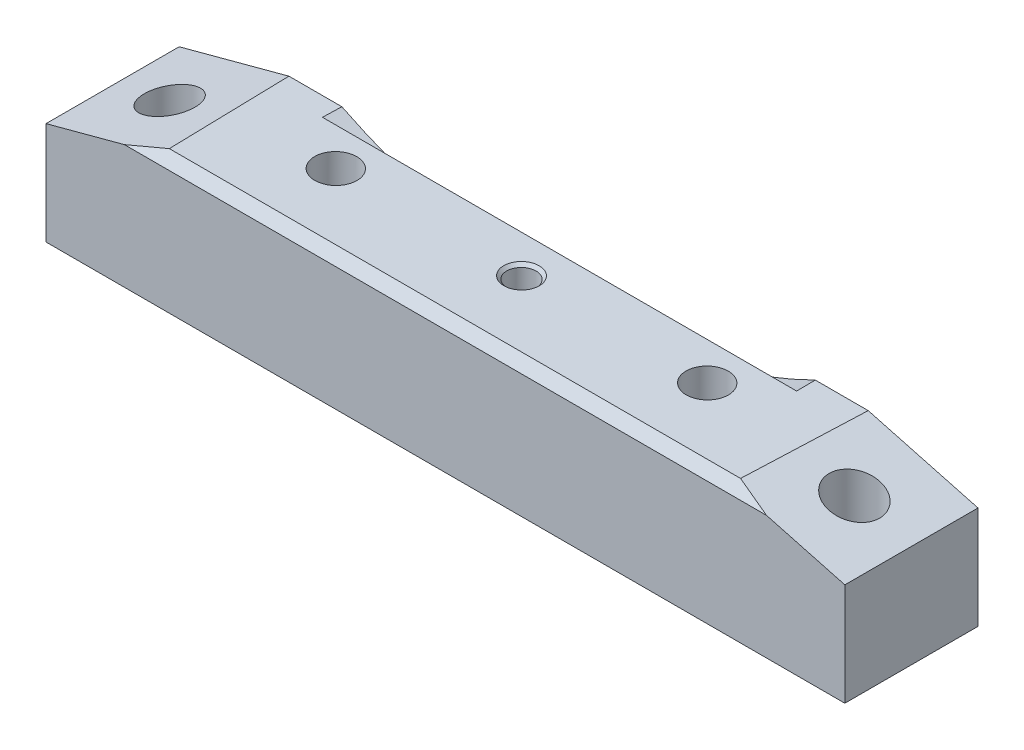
ISO-10303-21;
HEADER;
FILE_DESCRIPTION(('STEP AP214'),'2;1');
FILE_NAME('part.step','',(''),(''),'','','');
FILE_SCHEMA(('AUTOMOTIVE_DESIGN { 1 0 10303 214 1 1 1 1 }'));
ENDSEC;
DATA;
#1=APPLICATION_CONTEXT('core data for automotive mechanical design processes');
#2=APPLICATION_PROTOCOL_DEFINITION('international standard','automotive_design',2000,#1);
#3=PRODUCT_CONTEXT('',#1,'mechanical');
#4=PRODUCT('Part','Part','',(#3));
#5=PRODUCT_RELATED_PRODUCT_CATEGORY('part','',(#4));
#6=PRODUCT_DEFINITION_FORMATION('','',#4);
#7=PRODUCT_DEFINITION_CONTEXT('part definition',#1,'design');
#8=PRODUCT_DEFINITION('design','',#6,#7);
#9=PRODUCT_DEFINITION_SHAPE('','',#8);
#10=(LENGTH_UNIT() NAMED_UNIT(*) SI_UNIT(.MILLI.,.METRE.));
#11=(NAMED_UNIT(*) PLANE_ANGLE_UNIT() SI_UNIT($,.RADIAN.));
#12=(NAMED_UNIT(*) SI_UNIT($,.STERADIAN.) SOLID_ANGLE_UNIT());
#13=UNCERTAINTY_MEASURE_WITH_UNIT(LENGTH_MEASURE(1.E-05),#10,'distance_accuracy_value','');
#14=(GEOMETRIC_REPRESENTATION_CONTEXT(3) GLOBAL_UNCERTAINTY_ASSIGNED_CONTEXT((#13)) GLOBAL_UNIT_ASSIGNED_CONTEXT((#10,
#11,#12)) REPRESENTATION_CONTEXT('',''));
#15=CARTESIAN_POINT('',(0.,0.,0.));
#16=DIRECTION('',(0.,0.,1.));
#17=DIRECTION('',(1.,0.,0.));
#18=AXIS2_PLACEMENT_3D('',#15,#16,#17);
#19=CARTESIAN_POINT('',(0.,15.7644147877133,-1.53160292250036));
#20=DIRECTION('',(0.,0.999961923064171,-0.00872653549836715));
#21=DIRECTION('',(0.,0.00872653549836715,0.999961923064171));
#22=AXIS2_PLACEMENT_3D('',#19,#20,#21);
#23=PLANE('',#22);
#24=CARTESIAN_POINT('',(0.,15.7644147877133,-1.53160292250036));
#25=DIRECTION('',(0.,0.999961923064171,-0.00872653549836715));
#26=DIRECTION('',(0.,0.00872653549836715,0.999961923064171));
#27=AXIS2_PLACEMENT_3D('',#24,#25,#26);
#28=CIRCLE('',#27,2.4384);
#29=CARTESIAN_POINT('',(0.,15.7856935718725,0.90670423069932));
#30=VERTEX_POINT('',#29);
#31=EDGE_CURVE('E28',#30,#30,#28,.T.);
#32=ORIENTED_EDGE('',*,*,#31,.T.);
#33=EDGE_LOOP('',(#32));
#34=FACE_BOUND('',#33,.T.);
#35=ADVANCED_FACE('F25',(#34),#23,.T.);
#36=CARTESIAN_POINT('',(0.,15.7644147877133,-1.53160292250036));
#37=DIRECTION('',(0.,0.999961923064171,-0.00872653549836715));
#38=DIRECTION('',(0.,0.00872653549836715,0.999961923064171));
#39=AXIS2_PLACEMENT_3D('',#36,#37,#38);
#40=CYLINDRICAL_SURFACE('',#39,2.4384);
#41=CARTESIAN_POINT('',(0.,21.6061923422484,-1.58258334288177));
#42=DIRECTION('',(0.,0.999961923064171,-0.00872653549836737));
#43=DIRECTION('',(0.,0.00872653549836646,0.999961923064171));
#44=AXIS2_PLACEMENT_3D('',#41,#42,#43);
#45=CIRCLE('',#44,2.43840000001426);
#46=CARTESIAN_POINT('',(0.,21.6274711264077,0.855723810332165));
#47=VERTEX_POINT('',#46);
#48=EDGE_CURVE('E102',#47,#47,#45,.T.);
#49=ORIENTED_EDGE('',*,*,#48,.T.);
#50=EDGE_LOOP('',(#49));
#51=FACE_BOUND('',#50,.T.);
#52=ORIENTED_EDGE('',*,*,#31,.F.);
#53=EDGE_LOOP('',(#52));
#54=FACE_BOUND('',#53,.T.);
#55=ADVANCED_FACE('F295',(#51,#54),#40,.F.);
#56=CARTESIAN_POINT('',(0.,11.1252,0.));
#57=DIRECTION('',(0.,-1.,0.));
#58=DIRECTION('',(0.,0.,-1.));
#59=AXIS2_PLACEMENT_3D('',#56,#57,#58);
#60=PLANE('',#59);
#61=CARTESIAN_POINT('',(0.,11.1252,0.));
#62=DIRECTION('',(0.,-1.,0.));
#63=DIRECTION('',(0.,0.,-1.));
#64=AXIS2_PLACEMENT_3D('',#61,#62,#63);
#65=CIRCLE('',#64,3.16865);
#66=CARTESIAN_POINT('',(0.,11.1252,-3.16865));
#67=VERTEX_POINT('',#66);
#68=EDGE_CURVE('E180',#67,#67,#65,.T.);
#69=ORIENTED_EDGE('',*,*,#68,.T.);
#70=EDGE_LOOP('',(#69));
#71=FACE_BOUND('',#70,.T.);
#72=ADVANCED_FACE('F292',(#71),#60,.T.);
#73=CARTESIAN_POINT('',(31.0007,12.5895356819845,-1.50389617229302));
#74=DIRECTION('',(0.,0.999961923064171,-0.0087265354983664));
#75=DIRECTION('',(0.,0.0087265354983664,0.999961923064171));
#76=AXIS2_PLACEMENT_3D('',#73,#74,#75);
#77=PLANE('',#76);
#78=CARTESIAN_POINT('',(31.0007,12.5895356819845,-1.50389617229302));
#79=DIRECTION('',(0.,0.999961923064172,-0.0087265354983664));
#80=DIRECTION('',(0.,0.0087265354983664,0.999961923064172));
#81=AXIS2_PLACEMENT_3D('',#78,#79,#80);
#82=CIRCLE('',#81,6.9977);
#83=CARTESIAN_POINT('',(31.0007,12.6506013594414,5.49353737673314));
#84=VERTEX_POINT('',#83);
#85=EDGE_CURVE('E177',#84,#84,#82,.F.);
#86=ORIENTED_EDGE('',*,*,#85,.T.);
#87=EDGE_LOOP('',(#86));
#88=FACE_BOUND('',#87,.T.);
#89=CARTESIAN_POINT('',(31.0007,12.5895356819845,-1.50389617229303));
#90=DIRECTION('',(0.,0.999961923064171,-0.00872653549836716));
#91=DIRECTION('',(0.,0.00872653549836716,0.999961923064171));
#92=AXIS2_PLACEMENT_3D('',#89,#90,#91);
#93=CIRCLE('',#92,3.5052);
#94=CARTESIAN_POINT('',(31.0007,12.6201239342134,2.0011703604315));
#95=VERTEX_POINT('',#94);
#96=EDGE_CURVE('E183',#95,#95,#93,.T.);
#97=ORIENTED_EDGE('',*,*,#96,.T.);
#98=EDGE_LOOP('',(#97));
#99=FACE_BOUND('',#98,.T.);
#100=ADVANCED_FACE('F288',(#88,#99),#77,.F.);
#101=CARTESIAN_POINT('',(-31.0007,12.5895356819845,-1.50389617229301));
#102=DIRECTION('',(0.,0.999961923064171,-0.0087265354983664));
#103=DIRECTION('',(0.,0.0087265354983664,0.999961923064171));
#104=AXIS2_PLACEMENT_3D('',#101,#102,#103);
#105=PLANE('',#104);
#106=CARTESIAN_POINT('',(-31.0007,12.5895356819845,-1.50389617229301));
#107=DIRECTION('',(0.,0.999961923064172,-0.0087265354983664));
#108=DIRECTION('',(0.,0.0087265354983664,0.999961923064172));
#109=AXIS2_PLACEMENT_3D('',#106,#107,#108);
#110=CIRCLE('',#109,6.9977);
#111=CARTESIAN_POINT('',(-31.0007,12.6506013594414,5.49353737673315));
#112=VERTEX_POINT('',#111);
#113=EDGE_CURVE('E174',#112,#112,#110,.F.);
#114=ORIENTED_EDGE('',*,*,#113,.T.);
#115=EDGE_LOOP('',(#114));
#116=FACE_BOUND('',#115,.T.);
#117=CARTESIAN_POINT('',(-31.0007,12.5895356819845,-1.50389617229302));
#118=DIRECTION('',(0.,0.999961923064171,-0.00872653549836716));
#119=DIRECTION('',(0.,0.00872653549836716,0.999961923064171));
#120=AXIS2_PLACEMENT_3D('',#117,#118,#119);
#121=CIRCLE('',#120,3.5052);
#122=CARTESIAN_POINT('',(-31.0007,12.6201239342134,2.00117036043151));
#123=VERTEX_POINT('',#122);
#124=EDGE_CURVE('E101',#123,#123,#121,.T.);
#125=ORIENTED_EDGE('',*,*,#124,.T.);
#126=EDGE_LOOP('',(#125));
#127=FACE_BOUND('',#126,.T.);
#128=ADVANCED_FACE('F189',(#116,#127),#105,.F.);
#129=CARTESIAN_POINT('',(0.,22.114172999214,-1.58701642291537));
#130=DIRECTION('',(0.,0.999961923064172,-0.00872653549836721));
#131=DIRECTION('',(0.,0.00872653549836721,0.999961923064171));
#132=AXIS2_PLACEMENT_3D('',#129,#130,#131);
#133=CONICAL_SURFACE('',#132,2.946400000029,0.785398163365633);
#134=CARTESIAN_POINT('',(0.,22.1141729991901,-1.58701642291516));
#135=DIRECTION('',(0.,0.999961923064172,-0.00872653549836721));
#136=DIRECTION('',(0.,0.00872653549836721,0.999961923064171));
#137=AXIS2_PLACEMENT_3D('',#134,#135,#136);
#138=CIRCLE('',#137,2.94640000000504);
#139=CARTESIAN_POINT('',(0.,22.1398848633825,1.35927138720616));
#140=VERTEX_POINT('',#139);
#141=EDGE_CURVE('E125',#140,#140,#138,.T.);
#142=ORIENTED_EDGE('',*,*,#141,.T.);
#143=EDGE_LOOP('',(#142));
#144=FACE_BOUND('',#143,.T.);
#145=ORIENTED_EDGE('',*,*,#48,.F.);
#146=EDGE_LOOP('',(#145));
#147=FACE_BOUND('',#146,.T.);
#148=ADVANCED_FACE('F282',(#144,#147),#133,.F.);
#149=CARTESIAN_POINT('',(0.,101.665566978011,-7.9375));
#150=DIRECTION('',(0.,0.,-1.));
#151=DIRECTION('',(-1.,0.,0.));
#152=AXIS2_PLACEMENT_3D('',#149,#150,#151);
#153=PLANE('',#152);
#154=DIRECTION('',(1.,0.,0.));
#155=VECTOR('',#154,1.);
#156=CARTESIAN_POINT('',(-66.675,22.0587531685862,-7.9375));
#157=LINE('',#156,#155);
#158=CARTESIAN_POINT('',(-39.5722781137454,22.0587531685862,-7.93750000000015));
#159=VERTEX_POINT('',#158);
#160=CARTESIAN_POINT('',(39.5722781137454,22.0587531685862,-7.93750000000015));
#161=VERTEX_POINT('',#160);
#162=EDGE_CURVE('E94',#159,#161,#157,.T.);
#163=ORIENTED_EDGE('',*,*,#162,.T.);
#164=CARTESIAN_POINT('',(0.,101.665566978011,-7.9375));
#165=DIRECTION('',(0.,0.,-1.));
#166=DIRECTION('',(-1.,0.,0.));
#167=AXIS2_PLACEMENT_3D('',#164,#165,#166);
#168=CIRCLE('',#167,88.9);
#169=EDGE_CURVE('E96',#161,#159,#168,.T.);
#170=ORIENTED_EDGE('',*,*,#169,.T.);
#171=EDGE_LOOP('',(#163,#170));
#172=FACE_BOUND('',#171,.T.);
#173=ADVANCED_FACE('F98',(#172),#153,.T.);
#174=CARTESIAN_POINT('',(0.,101.665566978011,-7.9375));
#175=DIRECTION('',(0.,0.,-1.));
#176=DIRECTION('',(-1.,0.,0.));
#177=AXIS2_PLACEMENT_3D('',#174,#175,#176);
#178=CYLINDRICAL_SURFACE('',#177,88.9);
#179=CARTESIAN_POINT('',(0.,101.665566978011,9114.09983552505));
#180=DIRECTION('',(0.,-0.999961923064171,0.00872653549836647));
#181=DIRECTION('',(0.,-0.00872653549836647,-0.999961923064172));
#182=AXIS2_PLACEMENT_3D('',#179,#180,#181);
#183=ELLIPSE('',#182,10187.3188983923,88.9);
#184=CARTESIAN_POINT('',(-39.5164898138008,22.0310453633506,-11.1124999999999));
#185=VERTEX_POINT('',#184);
#186=EDGE_CURVE('E104',#185,#159,#183,.F.);
#187=ORIENTED_EDGE('',*,*,#186,.T.);
#188=ORIENTED_EDGE('',*,*,#169,.F.);
#189=CARTESIAN_POINT('',(0.,101.665566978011,9114.09983552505));
#190=DIRECTION('',(0.,-0.999961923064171,0.00872653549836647));
#191=DIRECTION('',(0.,-0.00872653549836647,-0.999961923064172));
#192=AXIS2_PLACEMENT_3D('',#189,#190,#191);
#193=ELLIPSE('',#192,10187.3188983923,88.9);
#194=CARTESIAN_POINT('',(39.5164898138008,22.0310453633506,-11.1124999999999));
#195=VERTEX_POINT('',#194);
#196=EDGE_CURVE('E116',#161,#195,#193,.F.);
#197=ORIENTED_EDGE('',*,*,#196,.T.);
#198=CARTESIAN_POINT('',(0.,101.665566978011,-11.1125));
#199=DIRECTION('',(0.,0.,-1.));
#200=DIRECTION('',(-1.,0.,0.));
#201=AXIS2_PLACEMENT_3D('',#198,#199,#200);
#202=CIRCLE('',#201,88.9);
#203=EDGE_CURVE('E107',#195,#185,#202,.T.);
#204=ORIENTED_EDGE('',*,*,#203,.T.);
#205=EDGE_LOOP('',(#187,#188,#197,#204));
#206=FACE_BOUND('',#205,.T.);
#207=ADVANCED_FACE('F105',(#206),#178,.F.);
#208=CARTESIAN_POINT('',(-31.0007,22.1141729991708,-1.58701642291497));
#209=DIRECTION('',(0.,0.999961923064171,-0.00872653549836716));
#210=DIRECTION('',(0.,0.00872653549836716,0.999961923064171));
#211=AXIS2_PLACEMENT_3D('',#208,#209,#210);
#212=CYLINDRICAL_SURFACE('',#211,3.5052);
#213=ORIENTED_EDGE('',*,*,#124,.F.);
#214=EDGE_LOOP('',(#213));
#215=FACE_BOUND('',#214,.T.);
#216=CARTESIAN_POINT('',(-31.0007,22.1141729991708,-1.58701642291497));
#217=DIRECTION('',(0.,0.999961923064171,-0.00872653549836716));
#218=DIRECTION('',(0.,0.00872653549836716,0.999961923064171));
#219=AXIS2_PLACEMENT_3D('',#216,#217,#218);
#220=CIRCLE('',#219,3.5052);
#221=CARTESIAN_POINT('',(-31.0007,22.1447612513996,1.91805010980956));
#222=VERTEX_POINT('',#221);
#223=EDGE_CURVE('E168',#222,#222,#220,.T.);
#224=ORIENTED_EDGE('',*,*,#223,.T.);
#225=EDGE_LOOP('',(#224));
#226=FACE_BOUND('',#225,.T.);
#227=ADVANCED_FACE('F191',(#215,#226),#212,.F.);
#228=CARTESIAN_POINT('',(31.0007,22.1141729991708,-1.58701642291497));
#229=DIRECTION('',(0.,0.999961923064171,-0.00872653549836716));
#230=DIRECTION('',(0.,0.00872653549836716,0.999961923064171));
#231=AXIS2_PLACEMENT_3D('',#228,#229,#230);
#232=CYLINDRICAL_SURFACE('',#231,3.5052);
#233=ORIENTED_EDGE('',*,*,#96,.F.);
#234=EDGE_LOOP('',(#233));
#235=FACE_BOUND('',#234,.T.);
#236=CARTESIAN_POINT('',(31.0007,22.1141729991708,-1.58701642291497));
#237=DIRECTION('',(0.,0.999961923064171,-0.00872653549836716));
#238=DIRECTION('',(0.,0.00872653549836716,0.999961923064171));
#239=AXIS2_PLACEMENT_3D('',#236,#237,#238);
#240=CIRCLE('',#239,3.5052);
#241=CARTESIAN_POINT('',(31.0007,22.1447612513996,1.91805010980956));
#242=VERTEX_POINT('',#241);
#243=EDGE_CURVE('E165',#242,#242,#240,.T.);
#244=ORIENTED_EDGE('',*,*,#243,.T.);
#245=EDGE_LOOP('',(#244));
#246=FACE_BOUND('',#245,.T.);
#247=ADVANCED_FACE('F194',(#235,#246),#232,.F.);
#248=CARTESIAN_POINT('',(0.,11.1252,0.));
#249=DIRECTION('',(0.,-1.,0.));
#250=DIRECTION('',(0.,0.,-1.));
#251=AXIS2_PLACEMENT_3D('',#248,#249,#250);
#252=CYLINDRICAL_SURFACE('',#251,3.16865);
#253=ORIENTED_EDGE('',*,*,#68,.F.);
#254=EDGE_LOOP('',(#253));
#255=FACE_BOUND('',#254,.T.);
#256=CARTESIAN_POINT('',(0.,0.,0.));
#257=DIRECTION('',(0.,-1.,0.));
#258=DIRECTION('',(0.,0.,-1.));
#259=AXIS2_PLACEMENT_3D('',#256,#257,#258);
#260=CIRCLE('',#259,3.16865);
#261=CARTESIAN_POINT('',(0.,0.,-3.16865));
#262=VERTEX_POINT('',#261);
#263=EDGE_CURVE('E158',#262,#262,#260,.T.);
#264=ORIENTED_EDGE('',*,*,#263,.T.);
#265=EDGE_LOOP('',(#264));
#266=FACE_BOUND('',#265,.T.);
#267=ADVANCED_FACE('F262',(#255,#266),#252,.F.);
#268=CARTESIAN_POINT('',(31.0007,-0.110143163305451,-1.39306775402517));
#269=DIRECTION('',(0.,0.999961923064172,-0.0087265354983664));
#270=DIRECTION('',(0.,0.0087265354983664,0.999961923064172));
#271=AXIS2_PLACEMENT_3D('',#268,#269,#270);
#272=CYLINDRICAL_SURFACE('',#271,6.9977);
#273=ORIENTED_EDGE('',*,*,#85,.F.);
#274=EDGE_LOOP('',(#273));
#275=FACE_BOUND('',#274,.T.);
#276=CARTESIAN_POINT('',(31.0007,0.,-1.39402895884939));
#277=DIRECTION('',(0.,1.,0.));
#278=DIRECTION('',(0.,0.,-1.));
#279=AXIS2_PLACEMENT_3D('',#276,#277,#278);
#280=ELLIPSE('',#279,6.99796646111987,6.9977);
#281=CARTESIAN_POINT('',(31.0007,0.,-8.39199541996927));
#282=VERTEX_POINT('',#281);
#283=EDGE_CURVE('E155',#282,#282,#280,.F.);
#284=ORIENTED_EDGE('',*,*,#283,.T.);
#285=EDGE_LOOP('',(#284));
#286=FACE_BOUND('',#285,.T.);
#287=ADVANCED_FACE('F264',(#275,#286),#272,.F.);
#288=CARTESIAN_POINT('',(-31.0007,-0.110143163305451,-1.39306775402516));
#289=DIRECTION('',(0.,0.999961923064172,-0.0087265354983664));
#290=DIRECTION('',(0.,0.0087265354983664,0.999961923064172));
#291=AXIS2_PLACEMENT_3D('',#288,#289,#290);
#292=CYLINDRICAL_SURFACE('',#291,6.9977);
#293=ORIENTED_EDGE('',*,*,#113,.F.);
#294=EDGE_LOOP('',(#293));
#295=FACE_BOUND('',#294,.T.);
#296=CARTESIAN_POINT('',(-31.0007,0.,-1.39402895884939));
#297=DIRECTION('',(0.,1.,0.));
#298=DIRECTION('',(0.,0.,-1.));
#299=AXIS2_PLACEMENT_3D('',#296,#297,#298);
#300=ELLIPSE('',#299,6.99796646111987,6.9977);
#301=CARTESIAN_POINT('',(-31.0007,0.,-8.39199541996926));
#302=VERTEX_POINT('',#301);
#303=EDGE_CURVE('E152',#302,#302,#300,.F.);
#304=ORIENTED_EDGE('',*,*,#303,.T.);
#305=EDGE_LOOP('',(#304));
#306=FACE_BOUND('',#305,.T.);
#307=ADVANCED_FACE('F251',(#295,#306),#292,.F.);
#308=CARTESIAN_POINT('',(-57.15,0.,0.));
#309=DIRECTION('',(0.,-1.,0.));
#310=DIRECTION('',(0.,0.,-1.));
#311=AXIS2_PLACEMENT_3D('',#308,#309,#310);
#312=CYLINDRICAL_SURFACE('',#311,4.21639999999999);
#313=CARTESIAN_POINT('',(-57.15,19.6727839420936,0.));
#314=DIRECTION('',(0.258819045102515,-0.96592582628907,0.));
#315=DIRECTION('',(-0.96592582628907,-0.258819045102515,0.));
#316=AXIS2_PLACEMENT_3D('',#313,#314,#315);
#317=ELLIPSE('',#316,4.36513848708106,4.21639999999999);
#318=CARTESIAN_POINT('',(-61.3664,18.5430029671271,0.));
#319=VERTEX_POINT('',#318);
#320=EDGE_CURVE('E131',#319,#319,#317,.F.);
#321=ORIENTED_EDGE('',*,*,#320,.T.);
#322=EDGE_LOOP('',(#321));
#323=FACE_BOUND('',#322,.T.);
#324=CARTESIAN_POINT('',(-57.15,0.,0.));
#325=DIRECTION('',(0.,-1.,0.));
#326=DIRECTION('',(0.,0.,-1.));
#327=AXIS2_PLACEMENT_3D('',#324,#325,#326);
#328=CIRCLE('',#327,4.21639999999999);
#329=CARTESIAN_POINT('',(-57.15,0.,-4.21639999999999));
#330=VERTEX_POINT('',#329);
#331=EDGE_CURVE('E149',#330,#330,#328,.T.);
#332=ORIENTED_EDGE('',*,*,#331,.T.);
#333=EDGE_LOOP('',(#332));
#334=FACE_BOUND('',#333,.T.);
#335=ADVANCED_FACE('F248',(#323,#334),#312,.F.);
#336=CARTESIAN_POINT('',(57.15,0.,0.));
#337=DIRECTION('',(0.,-1.,0.));
#338=DIRECTION('',(0.,0.,-1.));
#339=AXIS2_PLACEMENT_3D('',#336,#337,#338);
#340=CYLINDRICAL_SURFACE('',#339,4.21639999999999);
#341=CARTESIAN_POINT('',(57.15,19.6727839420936,0.));
#342=DIRECTION('',(-0.258819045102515,-0.96592582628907,0.));
#343=DIRECTION('',(0.96592582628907,-0.258819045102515,0.));
#344=AXIS2_PLACEMENT_3D('',#341,#342,#343);
#345=ELLIPSE('',#344,4.36513848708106,4.21639999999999);
#346=CARTESIAN_POINT('',(61.3664,18.5430029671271,0.));
#347=VERTEX_POINT('',#346);
#348=EDGE_CURVE('E140',#347,#347,#345,.F.);
#349=ORIENTED_EDGE('',*,*,#348,.T.);
#350=EDGE_LOOP('',(#349));
#351=FACE_BOUND('',#350,.T.);
#352=CARTESIAN_POINT('',(57.15,0.,0.));
#353=DIRECTION('',(0.,-1.,0.));
#354=DIRECTION('',(0.,0.,-1.));
#355=AXIS2_PLACEMENT_3D('',#352,#353,#354);
#356=CIRCLE('',#355,4.21639999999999);
#357=CARTESIAN_POINT('',(57.15,0.,-4.21639999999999));
#358=VERTEX_POINT('',#357);
#359=EDGE_CURVE('E145',#358,#358,#356,.T.);
#360=ORIENTED_EDGE('',*,*,#359,.T.);
#361=EDGE_LOOP('',(#360));
#362=FACE_BOUND('',#361,.T.);
#363=ADVANCED_FACE('F211',(#351,#362),#340,.F.);
#364=CARTESIAN_POINT('',(0.,0.,-11.1125));
#365=DIRECTION('',(0.,0.,1.));
#366=DIRECTION('',(1.,0.,0.));
#367=AXIS2_PLACEMENT_3D('',#364,#365,#366);
#368=PLANE('',#367);
#369=ORIENTED_EDGE('',*,*,#203,.F.);
#370=DIRECTION('',(1.,0.,0.));
#371=VECTOR('',#370,1.);
#372=CARTESIAN_POINT('',(-66.675,22.0310453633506,-11.1125));
#373=LINE('',#372,#371);
#374=CARTESIAN_POINT('',(48.348848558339,22.0310453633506,-11.1125));
#375=VERTEX_POINT('',#374);
#376=EDGE_CURVE('E118',#195,#375,#373,.T.);
#377=ORIENTED_EDGE('',*,*,#376,.T.);
#378=DIRECTION('',(0.96592582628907,-0.258819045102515,0.));
#379=VECTOR('',#378,1.);
#380=CARTESIAN_POINT('',(47.625,22.225,-11.1125));
#381=LINE('',#380,#379);
#382=CARTESIAN_POINT('',(66.675,17.1205678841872,-11.1125));
#383=VERTEX_POINT('',#382);
#384=EDGE_CURVE('E143',#375,#383,#381,.T.);
#385=ORIENTED_EDGE('',*,*,#384,.T.);
#386=DIRECTION('',(0.,1.,0.));
#387=VECTOR('',#386,1.);
#388=CARTESIAN_POINT('',(66.675,22.225,-11.1125));
#389=LINE('',#388,#387);
#390=CARTESIAN_POINT('',(66.675,0.,-11.1125));
#391=VERTEX_POINT('',#390);
#392=EDGE_CURVE('E144',#383,#391,#389,.F.);
#393=ORIENTED_EDGE('',*,*,#392,.T.);
#394=DIRECTION('',(1.,0.,0.));
#395=VECTOR('',#394,1.);
#396=CARTESIAN_POINT('',(-66.675,0.,-11.1125));
#397=LINE('',#396,#395);
#398=CARTESIAN_POINT('',(-66.675,0.,-11.1125));
#399=VERTEX_POINT('',#398);
#400=EDGE_CURVE('E497',#391,#399,#397,.F.);
#401=ORIENTED_EDGE('',*,*,#400,.T.);
#402=DIRECTION('',(0.,1.,0.));
#403=VECTOR('',#402,1.);
#404=CARTESIAN_POINT('',(-66.675,22.225,-11.1125));
#405=LINE('',#404,#403);
#406=CARTESIAN_POINT('',(-66.675,17.1205678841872,-11.1125));
#407=VERTEX_POINT('',#406);
#408=EDGE_CURVE('E472',#399,#407,#405,.T.);
#409=ORIENTED_EDGE('',*,*,#408,.T.);
#410=DIRECTION('',(0.96592582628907,0.258819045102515,0.));
#411=VECTOR('',#410,1.);
#412=CARTESIAN_POINT('',(-66.675,17.1205678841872,-11.1125));
#413=LINE('',#412,#411);
#414=CARTESIAN_POINT('',(-48.3488485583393,22.0310453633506,-11.1125));
#415=VERTEX_POINT('',#414);
#416=EDGE_CURVE('E128',#407,#415,#413,.T.);
#417=ORIENTED_EDGE('',*,*,#416,.T.);
#418=DIRECTION('',(1.,0.,0.));
#419=VECTOR('',#418,1.);
#420=CARTESIAN_POINT('',(-66.675,22.0310453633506,-11.1125));
#421=LINE('',#420,#419);
#422=EDGE_CURVE('E111',#415,#185,#421,.T.);
#423=ORIENTED_EDGE('',*,*,#422,.T.);
#424=EDGE_LOOP('',(#369,#377,#385,#393,#401,#409,#417,#423));
#425=FACE_BOUND('',#424,.T.);
#426=ADVANCED_FACE('F200',(#425),#368,.F.);
#427=CARTESIAN_POINT('',(-66.675,22.225,11.1125));
#428=DIRECTION('',(0.,-0.999961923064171,0.00872653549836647));
#429=DIRECTION('',(0.,-0.00872653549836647,-0.999961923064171));
#430=AXIS2_PLACEMENT_3D('',#427,#428,#429);
#431=PLANE('',#430);
#432=ORIENTED_EDGE('',*,*,#243,.F.);
#433=EDGE_LOOP('',(#432));
#434=FACE_BOUND('',#433,.T.);
#435=ORIENTED_EDGE('',*,*,#223,.F.);
#436=EDGE_LOOP('',(#435));
#437=FACE_BOUND('',#436,.T.);
#438=DIRECTION('',(1.,0.,0.));
#439=VECTOR('',#438,1.);
#440=CARTESIAN_POINT('',(66.675,22.2111560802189,9.52614391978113));
#441=LINE('',#440,#439);
#442=CARTESIAN_POINT('',(-47.6766662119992,22.2111560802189,9.52614391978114));
#443=VERTEX_POINT('',#442);
#444=CARTESIAN_POINT('',(47.6766662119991,22.2111560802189,9.52614391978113));
#445=VERTEX_POINT('',#444);
#446=EDGE_CURVE('E164',#443,#445,#441,.T.);
#447=ORIENTED_EDGE('',*,*,#446,.T.);
#448=DIRECTION('',(0.0325506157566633,-0.00872191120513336,-0.999432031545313));
#449=VECTOR('',#448,1.);
#450=CARTESIAN_POINT('',(47.6766662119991,22.2111560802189,9.52614391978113));
#451=LINE('',#450,#449);
#452=EDGE_CURVE('E481',#445,#375,#451,.T.);
#453=ORIENTED_EDGE('',*,*,#452,.T.);
#454=ORIENTED_EDGE('',*,*,#376,.F.);
#455=ORIENTED_EDGE('',*,*,#196,.F.);
#456=ORIENTED_EDGE('',*,*,#162,.F.);
#457=ORIENTED_EDGE('',*,*,#186,.F.);
#458=ORIENTED_EDGE('',*,*,#422,.F.);
#459=DIRECTION('',(0.0325506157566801,0.00872191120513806,0.999432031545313));
#460=VECTOR('',#459,1.);
#461=CARTESIAN_POINT('',(-48.3488485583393,22.0310453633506,-11.1125));
#462=LINE('',#461,#460);
#463=EDGE_CURVE('E130',#415,#443,#462,.T.);
#464=ORIENTED_EDGE('',*,*,#463,.T.);
#465=EDGE_LOOP('',(#447,#453,#454,#455,#456,#457,#458,#464));
#466=FACE_BOUND('',#465,.T.);
#467=ORIENTED_EDGE('',*,*,#141,.F.);
#468=EDGE_LOOP('',(#467));
#469=FACE_BOUND('',#468,.T.);
#470=ADVANCED_FACE('F113',(#434,#437,#466,#469),#431,.F.);
#471=CARTESIAN_POINT('',(66.675,22.225,9.5123));
#472=DIRECTION('',(0.,-0.707106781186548,-0.707106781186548));
#473=DIRECTION('',(0.,0.707106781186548,-0.707106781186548));
#474=AXIS2_PLACEMENT_3D('',#471,#472,#473);
#475=PLANE('',#474);
#476=DIRECTION('',(-0.935113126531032,0.250562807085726,-0.250562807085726));
#477=VECTOR('',#476,1.);
#478=CARTESIAN_POINT('',(53.5970277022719,20.6248,11.1125));
#479=LINE('',#478,#477);
#480=CARTESIAN_POINT('',(53.597027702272,20.6248,11.1125));
#481=VERTEX_POINT('',#480);
#482=EDGE_CURVE('E485',#481,#445,#479,.T.);
#483=ORIENTED_EDGE('',*,*,#482,.T.);
#484=ORIENTED_EDGE('',*,*,#446,.F.);
#485=DIRECTION('',(-0.935113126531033,-0.250562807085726,0.250562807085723));
#486=VECTOR('',#485,1.);
#487=CARTESIAN_POINT('',(-47.6766662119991,22.2111560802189,9.52614391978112));
#488=LINE('',#487,#486);
#489=CARTESIAN_POINT('',(-53.5970277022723,20.6248,11.1125));
#490=VERTEX_POINT('',#489);
#491=EDGE_CURVE('E135',#443,#490,#488,.T.);
#492=ORIENTED_EDGE('',*,*,#491,.T.);
#493=DIRECTION('',(1.,0.,0.));
#494=VECTOR('',#493,1.);
#495=CARTESIAN_POINT('',(0.,20.6248,11.1125));
#496=LINE('',#495,#494);
#497=EDGE_CURVE('E484',#481,#490,#496,.F.);
#498=ORIENTED_EDGE('',*,*,#497,.F.);
#499=EDGE_LOOP('',(#483,#484,#492,#498));
#500=FACE_BOUND('',#499,.T.);
#501=ADVANCED_FACE('F199',(#500),#475,.F.);
#502=CARTESIAN_POINT('',(-66.675,17.1205678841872,-11.1135));
#503=DIRECTION('',(0.258819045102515,-0.96592582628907,0.));
#504=DIRECTION('',(0.96592582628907,0.258819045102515,0.));
#505=AXIS2_PLACEMENT_3D('',#502,#503,#504);
#506=PLANE('',#505);
#507=ORIENTED_EDGE('',*,*,#491,.F.);
#508=ORIENTED_EDGE('',*,*,#463,.F.);
#509=ORIENTED_EDGE('',*,*,#416,.F.);
#510=DIRECTION('',(0.,0.,-1.));
#511=VECTOR('',#510,1.);
#512=CARTESIAN_POINT('',(-66.675,17.1205678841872,11.1125));
#513=LINE('',#512,#511);
#514=CARTESIAN_POINT('',(-66.675,17.1205678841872,11.1125));
#515=VERTEX_POINT('',#514);
#516=EDGE_CURVE('E161',#407,#515,#513,.F.);
#517=ORIENTED_EDGE('',*,*,#516,.T.);
#518=DIRECTION('',(-0.96592582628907,-0.258819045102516,0.));
#519=VECTOR('',#518,1.);
#520=CARTESIAN_POINT('',(-53.597027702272,20.6248,11.1125));
#521=LINE('',#520,#519);
#522=EDGE_CURVE('E469',#490,#515,#521,.T.);
#523=ORIENTED_EDGE('',*,*,#522,.F.);
#524=EDGE_LOOP('',(#507,#508,#509,#517,#523));
#525=FACE_BOUND('',#524,.T.);
#526=ORIENTED_EDGE('',*,*,#320,.F.);
#527=EDGE_LOOP('',(#526));
#528=FACE_BOUND('',#527,.T.);
#529=ADVANCED_FACE('F208',(#525,#528),#506,.F.);
#530=CARTESIAN_POINT('',(-66.675,22.225,11.1125));
#531=DIRECTION('',(1.,0.,0.));
#532=DIRECTION('',(0.,0.,-1.));
#533=AXIS2_PLACEMENT_3D('',#530,#531,#532);
#534=PLANE('',#533);
#535=ORIENTED_EDGE('',*,*,#516,.F.);
#536=ORIENTED_EDGE('',*,*,#408,.F.);
#537=DIRECTION('',(0.,0.,1.));
#538=VECTOR('',#537,1.);
#539=CARTESIAN_POINT('',(-66.675,0.,11.1125));
#540=LINE('',#539,#538);
#541=CARTESIAN_POINT('',(-66.675,0.,11.1125));
#542=VERTEX_POINT('',#541);
#543=EDGE_CURVE('E148',#399,#542,#540,.T.);
#544=ORIENTED_EDGE('',*,*,#543,.T.);
#545=DIRECTION('',(0.,1.,0.));
#546=VECTOR('',#545,1.);
#547=CARTESIAN_POINT('',(-66.675,0.,11.1125));
#548=LINE('',#547,#546);
#549=EDGE_CURVE('E503',#515,#542,#548,.F.);
#550=ORIENTED_EDGE('',*,*,#549,.F.);
#551=EDGE_LOOP('',(#535,#536,#544,#550));
#552=FACE_BOUND('',#551,.T.);
#553=ADVANCED_FACE('F233',(#552),#534,.F.);
#554=CARTESIAN_POINT('',(-66.675,0.,11.1125));
#555=DIRECTION('',(0.,1.,0.));
#556=DIRECTION('',(0.,0.,1.));
#557=AXIS2_PLACEMENT_3D('',#554,#555,#556);
#558=PLANE('',#557);
#559=DIRECTION('',(0.,0.,1.));
#560=VECTOR('',#559,1.);
#561=CARTESIAN_POINT('',(66.675,0.,11.1125));
#562=LINE('',#561,#560);
#563=CARTESIAN_POINT('',(66.675,0.,11.1125));
#564=VERTEX_POINT('',#563);
#565=EDGE_CURVE('E495',#391,#564,#562,.T.);
#566=ORIENTED_EDGE('',*,*,#565,.T.);
#567=DIRECTION('',(1.,0.,0.));
#568=VECTOR('',#567,1.);
#569=CARTESIAN_POINT('',(0.,0.,11.1125));
#570=LINE('',#569,#568);
#571=EDGE_CURVE('E507',#542,#564,#570,.T.);
#572=ORIENTED_EDGE('',*,*,#571,.F.);
#573=ORIENTED_EDGE('',*,*,#543,.F.);
#574=ORIENTED_EDGE('',*,*,#400,.F.);
#575=EDGE_LOOP('',(#566,#572,#573,#574));
#576=FACE_BOUND('',#575,.T.);
#577=ORIENTED_EDGE('',*,*,#359,.F.);
#578=EDGE_LOOP('',(#577));
#579=FACE_BOUND('',#578,.T.);
#580=ORIENTED_EDGE('',*,*,#331,.F.);
#581=EDGE_LOOP('',(#580));
#582=FACE_BOUND('',#581,.T.);
#583=ORIENTED_EDGE('',*,*,#303,.F.);
#584=EDGE_LOOP('',(#583));
#585=FACE_BOUND('',#584,.T.);
#586=ORIENTED_EDGE('',*,*,#283,.F.);
#587=EDGE_LOOP('',(#586));
#588=FACE_BOUND('',#587,.T.);
#589=ORIENTED_EDGE('',*,*,#263,.F.);
#590=EDGE_LOOP('',(#589));
#591=FACE_BOUND('',#590,.T.);
#592=ADVANCED_FACE('F230',(#576,#579,#582,#585,#588,#591),#558,.F.);
#593=CARTESIAN_POINT('',(66.675,22.225,11.1125));
#594=DIRECTION('',(-1.,0.,0.));
#595=DIRECTION('',(0.,0.,1.));
#596=AXIS2_PLACEMENT_3D('',#593,#594,#595);
#597=PLANE('',#596);
#598=DIRECTION('',(0.,0.,1.));
#599=VECTOR('',#598,1.);
#600=CARTESIAN_POINT('',(66.675,17.1205678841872,-11.1135));
#601=LINE('',#600,#599);
#602=CARTESIAN_POINT('',(66.675,17.1205678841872,11.1125));
#603=VERTEX_POINT('',#602);
#604=EDGE_CURVE('E43',#383,#603,#601,.T.);
#605=ORIENTED_EDGE('',*,*,#604,.T.);
#606=DIRECTION('',(0.,1.,0.));
#607=VECTOR('',#606,1.);
#608=CARTESIAN_POINT('',(66.675,0.,11.1125));
#609=LINE('',#608,#607);
#610=EDGE_CURVE('E34',#564,#603,#609,.T.);
#611=ORIENTED_EDGE('',*,*,#610,.F.);
#612=ORIENTED_EDGE('',*,*,#565,.F.);
#613=ORIENTED_EDGE('',*,*,#392,.F.);
#614=EDGE_LOOP('',(#605,#611,#612,#613));
#615=FACE_BOUND('',#614,.T.);
#616=ADVANCED_FACE('F223',(#615),#597,.F.);
#617=CARTESIAN_POINT('',(47.625,22.225,-11.1135));
#618=DIRECTION('',(-0.258819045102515,-0.96592582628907,0.));
#619=DIRECTION('',(0.96592582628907,-0.258819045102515,0.));
#620=AXIS2_PLACEMENT_3D('',#617,#618,#619);
#621=PLANE('',#620);
#622=ORIENTED_EDGE('',*,*,#482,.F.);
#623=DIRECTION('',(-0.96592582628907,0.258819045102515,0.));
#624=VECTOR('',#623,1.);
#625=CARTESIAN_POINT('',(66.675,17.1205678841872,11.1125));
#626=LINE('',#625,#624);
#627=EDGE_CURVE('E13',#603,#481,#626,.T.);
#628=ORIENTED_EDGE('',*,*,#627,.F.);
#629=ORIENTED_EDGE('',*,*,#604,.F.);
#630=ORIENTED_EDGE('',*,*,#384,.F.);
#631=ORIENTED_EDGE('',*,*,#452,.F.);
#632=EDGE_LOOP('',(#622,#628,#629,#630,#631));
#633=FACE_BOUND('',#632,.T.);
#634=ORIENTED_EDGE('',*,*,#348,.F.);
#635=EDGE_LOOP('',(#634));
#636=FACE_BOUND('',#635,.T.);
#637=ADVANCED_FACE('F217',(#633,#636),#621,.F.);
#638=CARTESIAN_POINT('',(0.,0.,11.1125));
#639=DIRECTION('',(0.,0.,1.));
#640=DIRECTION('',(1.,0.,0.));
#641=AXIS2_PLACEMENT_3D('',#638,#639,#640);
#642=PLANE('',#641);
#643=ORIENTED_EDGE('',*,*,#610,.T.);
#644=ORIENTED_EDGE('',*,*,#627,.T.);
#645=ORIENTED_EDGE('',*,*,#497,.T.);
#646=ORIENTED_EDGE('',*,*,#522,.T.);
#647=ORIENTED_EDGE('',*,*,#549,.T.);
#648=ORIENTED_EDGE('',*,*,#571,.T.);
#649=EDGE_LOOP('',(#643,#644,#645,#646,#647,#648));
#650=FACE_BOUND('',#649,.T.);
#651=ADVANCED_FACE('F215',(#650),#642,.T.);
#652=CLOSED_SHELL('',(#35,#55,#72,#100,#128,#148,#173,#207,#227,#247,#267,#287,#307,#335,#363,
#426,#470,#501,#529,#553,#592,#616,#637,#651));
#653=MANIFOLD_SOLID_BREP('B1',#652);
#654=ADVANCED_BREP_SHAPE_REPRESENTATION('',(#18,#653),#14);
#655=SHAPE_DEFINITION_REPRESENTATION(#9,#654);
ENDSEC;
END-ISO-10303-21;
